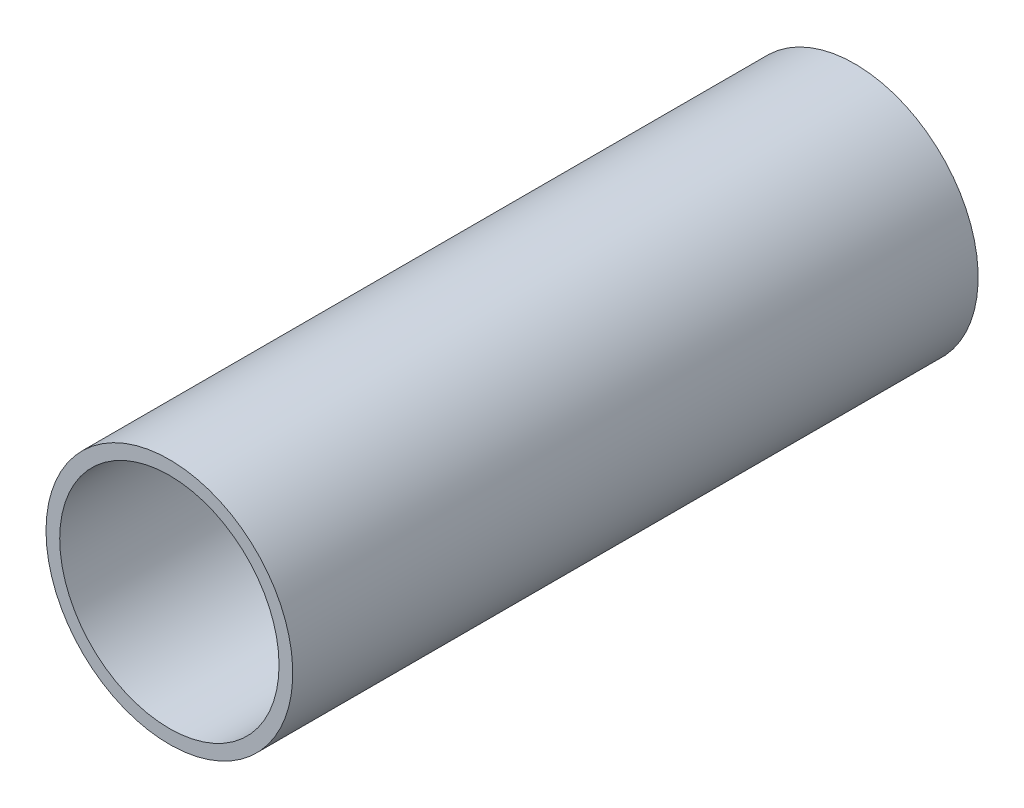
ISO-10303-21;
HEADER;
FILE_DESCRIPTION(('STEP AP214'),'2;1');
FILE_NAME('part.step','',(''),(''),'','','');
FILE_SCHEMA(('AUTOMOTIVE_DESIGN { 1 0 10303 214 1 1 1 1 }'));
ENDSEC;
DATA;
#1=APPLICATION_CONTEXT('core data for automotive mechanical design processes');
#2=APPLICATION_PROTOCOL_DEFINITION('international standard','automotive_design',2000,#1);
#3=PRODUCT_CONTEXT('',#1,'mechanical');
#4=PRODUCT('Part','Part','',(#3));
#5=PRODUCT_RELATED_PRODUCT_CATEGORY('part','',(#4));
#6=PRODUCT_DEFINITION_FORMATION('','',#4);
#7=PRODUCT_DEFINITION_CONTEXT('part definition',#1,'design');
#8=PRODUCT_DEFINITION('design','',#6,#7);
#9=PRODUCT_DEFINITION_SHAPE('','',#8);
#10=(LENGTH_UNIT() NAMED_UNIT(*) SI_UNIT(.MILLI.,.METRE.));
#11=(NAMED_UNIT(*) PLANE_ANGLE_UNIT() SI_UNIT($,.RADIAN.));
#12=(NAMED_UNIT(*) SI_UNIT($,.STERADIAN.) SOLID_ANGLE_UNIT());
#13=UNCERTAINTY_MEASURE_WITH_UNIT(LENGTH_MEASURE(1.E-05),#10,'distance_accuracy_value','');
#14=(GEOMETRIC_REPRESENTATION_CONTEXT(3) GLOBAL_UNCERTAINTY_ASSIGNED_CONTEXT((#13)) GLOBAL_UNIT_ASSIGNED_CONTEXT((#10,
#11,#12)) REPRESENTATION_CONTEXT('',''));
#15=CARTESIAN_POINT('',(0.,0.,0.));
#16=DIRECTION('',(0.,0.,1.));
#17=DIRECTION('',(1.,0.,0.));
#18=AXIS2_PLACEMENT_3D('',#15,#16,#17);
#19=CARTESIAN_POINT('',(0.,0.,100.));
#20=DIRECTION('',(0.,0.,1.));
#21=DIRECTION('',(1.,0.,0.));
#22=AXIS2_PLACEMENT_3D('',#19,#20,#21);
#23=PLANE('',#22);
#24=CARTESIAN_POINT('',(0.,0.,100.));
#25=DIRECTION('',(0.,0.,1.));
#26=DIRECTION('',(1.,0.,0.));
#27=AXIS2_PLACEMENT_3D('',#24,#25,#26);
#28=CIRCLE('',#27,18.);
#29=CARTESIAN_POINT('',(-18.,0.,100.));
#30=VERTEX_POINT('',#29);
#31=EDGE_CURVE('E12',#30,#30,#28,.T.);
#32=ORIENTED_EDGE('',*,*,#31,.T.);
#33=EDGE_LOOP('',(#32));
#34=FACE_BOUND('',#33,.T.);
#35=CARTESIAN_POINT('',(0.,0.,100.));
#36=DIRECTION('',(0.,0.,1.));
#37=DIRECTION('',(1.,0.,0.));
#38=AXIS2_PLACEMENT_3D('',#35,#36,#37);
#39=CIRCLE('',#38,16.);
#40=CARTESIAN_POINT('',(-16.,0.,100.));
#41=VERTEX_POINT('',#40);
#42=EDGE_CURVE('E365',#41,#41,#39,.T.);
#43=ORIENTED_EDGE('',*,*,#42,.F.);
#44=EDGE_LOOP('',(#43));
#45=FACE_BOUND('',#44,.T.);
#46=ADVANCED_FACE('F354',(#34,#45),#23,.T.);
#47=CARTESIAN_POINT('',(0.,0.,0.));
#48=DIRECTION('',(0.,0.,1.));
#49=DIRECTION('',(1.,0.,0.));
#50=AXIS2_PLACEMENT_3D('',#47,#48,#49);
#51=PLANE('',#50);
#52=CARTESIAN_POINT('',(0.,0.,0.));
#53=DIRECTION('',(0.,0.,1.));
#54=DIRECTION('',(1.,0.,0.));
#55=AXIS2_PLACEMENT_3D('',#52,#53,#54);
#56=CIRCLE('',#55,18.);
#57=CARTESIAN_POINT('',(-18.,0.,0.));
#58=VERTEX_POINT('',#57);
#59=EDGE_CURVE('E361',#58,#58,#56,.T.);
#60=ORIENTED_EDGE('',*,*,#59,.F.);
#61=EDGE_LOOP('',(#60));
#62=FACE_BOUND('',#61,.T.);
#63=CARTESIAN_POINT('',(0.,0.,0.));
#64=DIRECTION('',(0.,0.,1.));
#65=DIRECTION('',(1.,0.,0.));
#66=AXIS2_PLACEMENT_3D('',#63,#64,#65);
#67=CIRCLE('',#66,16.);
#68=CARTESIAN_POINT('',(-16.,0.,0.));
#69=VERTEX_POINT('',#68);
#70=EDGE_CURVE('E369',#69,#69,#67,.T.);
#71=ORIENTED_EDGE('',*,*,#70,.T.);
#72=EDGE_LOOP('',(#71));
#73=FACE_BOUND('',#72,.T.);
#74=ADVANCED_FACE('F375',(#62,#73),#51,.F.);
#75=CARTESIAN_POINT('',(0.,0.,100.));
#76=DIRECTION('',(0.,0.,-1.));
#77=DIRECTION('',(-1.,0.,0.));
#78=AXIS2_PLACEMENT_3D('',#75,#76,#77);
#79=CYLINDRICAL_SURFACE('',#78,18.);
#80=CARTESIAN_POINT('',(-18.,0.,100.));
#81=CARTESIAN_POINT('',(-18.,0.,98.9583333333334));
#82=CARTESIAN_POINT('',(-18.,0.,97.9166666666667));
#83=CARTESIAN_POINT('',(-18.,0.,95.8333333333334));
#84=CARTESIAN_POINT('',(-18.,0.,94.7916666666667));
#85=CARTESIAN_POINT('',(-18.,0.,92.7083333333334));
#86=CARTESIAN_POINT('',(-18.,0.,91.6666666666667));
#87=CARTESIAN_POINT('',(-18.,0.,89.5833333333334));
#88=CARTESIAN_POINT('',(-18.,0.,88.5416666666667));
#89=CARTESIAN_POINT('',(-18.,0.,86.4583333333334));
#90=CARTESIAN_POINT('',(-18.,0.,85.4166666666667));
#91=CARTESIAN_POINT('',(-18.,0.,83.3333333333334));
#92=CARTESIAN_POINT('',(-18.,0.,82.2916666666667));
#93=CARTESIAN_POINT('',(-18.,0.,80.2083333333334));
#94=CARTESIAN_POINT('',(-18.,0.,79.1666666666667));
#95=CARTESIAN_POINT('',(-18.,0.,77.0833333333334));
#96=CARTESIAN_POINT('',(-18.,0.,76.0416666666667));
#97=CARTESIAN_POINT('',(-18.,0.,73.9583333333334));
#98=CARTESIAN_POINT('',(-18.,0.,72.9166666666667));
#99=CARTESIAN_POINT('',(-18.,0.,70.8333333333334));
#100=CARTESIAN_POINT('',(-18.,0.,69.7916666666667));
#101=CARTESIAN_POINT('',(-18.,0.,67.7083333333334));
#102=CARTESIAN_POINT('',(-18.,0.,66.6666666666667));
#103=CARTESIAN_POINT('',(-18.,0.,64.5833333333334));
#104=CARTESIAN_POINT('',(-18.,0.,63.5416666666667));
#105=CARTESIAN_POINT('',(-18.,0.,61.4583333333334));
#106=CARTESIAN_POINT('',(-18.,0.,60.4166666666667));
#107=CARTESIAN_POINT('',(-18.,0.,58.3333333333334));
#108=CARTESIAN_POINT('',(-18.,0.,57.2916666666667));
#109=CARTESIAN_POINT('',(-18.,0.,55.2083333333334));
#110=CARTESIAN_POINT('',(-18.,0.,54.1666666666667));
#111=CARTESIAN_POINT('',(-18.,0.,52.0833333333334));
#112=CARTESIAN_POINT('',(-18.,0.,51.0416666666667));
#113=CARTESIAN_POINT('',(-18.,0.,48.9583333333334));
#114=CARTESIAN_POINT('',(-18.,0.,47.9166666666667));
#115=CARTESIAN_POINT('',(-18.,0.,45.8333333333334));
#116=CARTESIAN_POINT('',(-18.,0.,44.7916666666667));
#117=CARTESIAN_POINT('',(-18.,0.,42.7083333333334));
#118=CARTESIAN_POINT('',(-18.,0.,41.6666666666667));
#119=CARTESIAN_POINT('',(-18.,0.,39.5833333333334));
#120=CARTESIAN_POINT('',(-18.,0.,38.5416666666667));
#121=CARTESIAN_POINT('',(-18.,0.,36.4583333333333));
#122=CARTESIAN_POINT('',(-18.,0.,35.4166666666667));
#123=CARTESIAN_POINT('',(-18.,0.,33.3333333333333));
#124=CARTESIAN_POINT('',(-18.,0.,32.2916666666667));
#125=CARTESIAN_POINT('',(-18.,0.,30.2083333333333));
#126=CARTESIAN_POINT('',(-18.,0.,29.1666666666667));
#127=CARTESIAN_POINT('',(-18.,0.,27.0833333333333));
#128=CARTESIAN_POINT('',(-18.,0.,26.0416666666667));
#129=CARTESIAN_POINT('',(-18.,0.,23.9583333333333));
#130=CARTESIAN_POINT('',(-18.,0.,22.9166666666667));
#131=CARTESIAN_POINT('',(-18.,0.,20.8333333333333));
#132=CARTESIAN_POINT('',(-18.,0.,19.7916666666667));
#133=CARTESIAN_POINT('',(-18.,0.,17.7083333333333));
#134=CARTESIAN_POINT('',(-18.,0.,16.6666666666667));
#135=CARTESIAN_POINT('',(-18.,0.,14.5833333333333));
#136=CARTESIAN_POINT('',(-18.,0.,13.5416666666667));
#137=CARTESIAN_POINT('',(-18.,0.,11.4583333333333));
#138=CARTESIAN_POINT('',(-18.,0.,10.4166666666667));
#139=CARTESIAN_POINT('',(-18.,0.,8.33333333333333));
#140=CARTESIAN_POINT('',(-18.,0.,7.29166666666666));
#141=CARTESIAN_POINT('',(-18.,0.,5.20833333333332));
#142=CARTESIAN_POINT('',(-18.,0.,4.16666666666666));
#143=CARTESIAN_POINT('',(-18.,0.,2.08333333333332));
#144=CARTESIAN_POINT('',(-18.,0.,1.04166666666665));
#145=CARTESIAN_POINT('',(-18.,0.,0.));
#146=B_SPLINE_CURVE_WITH_KNOTS('',3,(#80,#81,#82,#83,#84,#85,#86,#87,#88,#89,#90,#91,#92,#93,
#94,#95,#96,#97,#98,#99,#100,#101,#102,#103,#104,#105,#106,#107,#108,#109,#110,#111,#112,#113,
#114,#115,#116,#117,#118,#119,#120,#121,#122,#123,#124,#125,#126,#127,#128,#129,#130,#131,#132,
#133,#134,#135,#136,#137,#138,#139,#140,#141,#142,#143,#144,#145),.UNSPECIFIED.,.F.,.F.,(4,2,2,
2,2,2,2,2,2,2,2,2,2,2,2,2,2,2,2,2,2,2,2,2,2,2,2,2,2,2,2,2,4),(0.,3.125,6.24999999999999,
9.37500000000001,12.5,15.625,18.75,21.875,25.,28.125,31.25,34.375,37.5,40.625,43.75,46.875,50.,
53.125,56.25,59.375,62.5000000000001,65.6250000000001,68.7500000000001,71.8750000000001,
75.0000000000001,78.1250000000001,81.2500000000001,84.3750000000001,87.5000000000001,
90.6250000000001,93.7500000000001,96.8750000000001,100.),.UNSPECIFIED.);
#147=EDGE_CURVE('BSEAM356',#30,#58,#146,.T.);
#148=ORIENTED_EDGE('',*,*,#31,.F.);
#149=ORIENTED_EDGE('',*,*,#59,.T.);
#150=ORIENTED_EDGE('',*,*,#147,.T.);
#151=ORIENTED_EDGE('',*,*,#147,.F.);
#152=EDGE_LOOP('',(#148,#150,#149,#151));
#153=FACE_BOUND('',#152,.T.);
#154=ADVANCED_FACE('F356',(#153),#79,.T.);
#155=CARTESIAN_POINT('',(0.,0.,100.));
#156=DIRECTION('',(0.,0.,-1.));
#157=DIRECTION('',(-1.,0.,0.));
#158=AXIS2_PLACEMENT_3D('',#155,#156,#157);
#159=CYLINDRICAL_SURFACE('',#158,16.);
#160=CARTESIAN_POINT('',(-16.,0.,100.));
#161=CARTESIAN_POINT('',(-16.,0.,98.9583333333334));
#162=CARTESIAN_POINT('',(-16.,0.,97.9166666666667));
#163=CARTESIAN_POINT('',(-16.,0.,95.8333333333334));
#164=CARTESIAN_POINT('',(-16.,0.,94.7916666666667));
#165=CARTESIAN_POINT('',(-16.,0.,92.7083333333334));
#166=CARTESIAN_POINT('',(-16.,0.,91.6666666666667));
#167=CARTESIAN_POINT('',(-16.,0.,89.5833333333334));
#168=CARTESIAN_POINT('',(-16.,0.,88.5416666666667));
#169=CARTESIAN_POINT('',(-16.,0.,86.4583333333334));
#170=CARTESIAN_POINT('',(-16.,0.,85.4166666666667));
#171=CARTESIAN_POINT('',(-16.,0.,83.3333333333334));
#172=CARTESIAN_POINT('',(-16.,0.,82.2916666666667));
#173=CARTESIAN_POINT('',(-16.,0.,80.2083333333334));
#174=CARTESIAN_POINT('',(-16.,0.,79.1666666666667));
#175=CARTESIAN_POINT('',(-16.,0.,77.0833333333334));
#176=CARTESIAN_POINT('',(-16.,0.,76.0416666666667));
#177=CARTESIAN_POINT('',(-16.,0.,73.9583333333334));
#178=CARTESIAN_POINT('',(-16.,0.,72.9166666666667));
#179=CARTESIAN_POINT('',(-16.,0.,70.8333333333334));
#180=CARTESIAN_POINT('',(-16.,0.,69.7916666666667));
#181=CARTESIAN_POINT('',(-16.,0.,67.7083333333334));
#182=CARTESIAN_POINT('',(-16.,0.,66.6666666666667));
#183=CARTESIAN_POINT('',(-16.,0.,64.5833333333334));
#184=CARTESIAN_POINT('',(-16.,0.,63.5416666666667));
#185=CARTESIAN_POINT('',(-16.,0.,61.4583333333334));
#186=CARTESIAN_POINT('',(-16.,0.,60.4166666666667));
#187=CARTESIAN_POINT('',(-16.,0.,58.3333333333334));
#188=CARTESIAN_POINT('',(-16.,0.,57.2916666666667));
#189=CARTESIAN_POINT('',(-16.,0.,55.2083333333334));
#190=CARTESIAN_POINT('',(-16.,0.,54.1666666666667));
#191=CARTESIAN_POINT('',(-16.,0.,52.0833333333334));
#192=CARTESIAN_POINT('',(-16.,0.,51.0416666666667));
#193=CARTESIAN_POINT('',(-16.,0.,48.9583333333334));
#194=CARTESIAN_POINT('',(-16.,0.,47.9166666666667));
#195=CARTESIAN_POINT('',(-16.,0.,45.8333333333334));
#196=CARTESIAN_POINT('',(-16.,0.,44.7916666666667));
#197=CARTESIAN_POINT('',(-16.,0.,42.7083333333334));
#198=CARTESIAN_POINT('',(-16.,0.,41.6666666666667));
#199=CARTESIAN_POINT('',(-16.,0.,39.5833333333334));
#200=CARTESIAN_POINT('',(-16.,0.,38.5416666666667));
#201=CARTESIAN_POINT('',(-16.,0.,36.4583333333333));
#202=CARTESIAN_POINT('',(-16.,0.,35.4166666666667));
#203=CARTESIAN_POINT('',(-16.,0.,33.3333333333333));
#204=CARTESIAN_POINT('',(-16.,0.,32.2916666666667));
#205=CARTESIAN_POINT('',(-16.,0.,30.2083333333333));
#206=CARTESIAN_POINT('',(-16.,0.,29.1666666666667));
#207=CARTESIAN_POINT('',(-16.,0.,27.0833333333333));
#208=CARTESIAN_POINT('',(-16.,0.,26.0416666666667));
#209=CARTESIAN_POINT('',(-16.,0.,23.9583333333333));
#210=CARTESIAN_POINT('',(-16.,0.,22.9166666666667));
#211=CARTESIAN_POINT('',(-16.,0.,20.8333333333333));
#212=CARTESIAN_POINT('',(-16.,0.,19.7916666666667));
#213=CARTESIAN_POINT('',(-16.,0.,17.7083333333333));
#214=CARTESIAN_POINT('',(-16.,0.,16.6666666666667));
#215=CARTESIAN_POINT('',(-16.,0.,14.5833333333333));
#216=CARTESIAN_POINT('',(-16.,0.,13.5416666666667));
#217=CARTESIAN_POINT('',(-16.,0.,11.4583333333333));
#218=CARTESIAN_POINT('',(-16.,0.,10.4166666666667));
#219=CARTESIAN_POINT('',(-16.,0.,8.33333333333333));
#220=CARTESIAN_POINT('',(-16.,0.,7.29166666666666));
#221=CARTESIAN_POINT('',(-16.,0.,5.20833333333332));
#222=CARTESIAN_POINT('',(-16.,0.,4.16666666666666));
#223=CARTESIAN_POINT('',(-16.,0.,2.08333333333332));
#224=CARTESIAN_POINT('',(-16.,0.,1.04166666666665));
#225=CARTESIAN_POINT('',(-16.,0.,0.));
#226=B_SPLINE_CURVE_WITH_KNOTS('',3,(#160,#161,#162,#163,#164,#165,#166,#167,#168,#169,#170,
#171,#172,#173,#174,#175,#176,#177,#178,#179,#180,#181,#182,#183,#184,#185,#186,#187,#188,#189,
#190,#191,#192,#193,#194,#195,#196,#197,#198,#199,#200,#201,#202,#203,#204,#205,#206,#207,#208,
#209,#210,#211,#212,#213,#214,#215,#216,#217,#218,#219,#220,#221,#222,#223,#224,#225),
.UNSPECIFIED.,.F.,.F.,(4,2,2,2,2,2,2,2,2,2,2,2,2,2,2,2,2,2,2,2,2,2,2,2,2,2,2,2,2,2,2,2,4),(0.,
3.125,6.24999999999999,9.37500000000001,12.5,15.625,18.75,21.875,25.,28.125,31.25,34.375,37.5,
40.625,43.75,46.875,50.,53.125,56.25,59.375,62.5000000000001,65.6250000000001,68.7500000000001,
71.8750000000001,75.0000000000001,78.1250000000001,81.2500000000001,84.3750000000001,
87.5000000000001,90.6250000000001,93.7500000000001,96.8750000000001,100.),.UNSPECIFIED.);
#227=EDGE_CURVE('BSEAM377',#41,#69,#226,.T.);
#228=ORIENTED_EDGE('',*,*,#42,.T.);
#229=ORIENTED_EDGE('',*,*,#70,.F.);
#230=ORIENTED_EDGE('',*,*,#227,.T.);
#231=ORIENTED_EDGE('',*,*,#227,.F.);
#232=EDGE_LOOP('',(#228,#230,#229,#231));
#233=FACE_BOUND('',#232,.T.);
#234=ADVANCED_FACE('F377',(#233),#159,.F.);
#235=CLOSED_SHELL('',(#46,#74,#154,#234));
#236=MANIFOLD_SOLID_BREP('B2',#235);
#237=ADVANCED_BREP_SHAPE_REPRESENTATION('',(#18,#236),#14);
#238=SHAPE_DEFINITION_REPRESENTATION(#9,#237);
ENDSEC;
END-ISO-10303-21;
